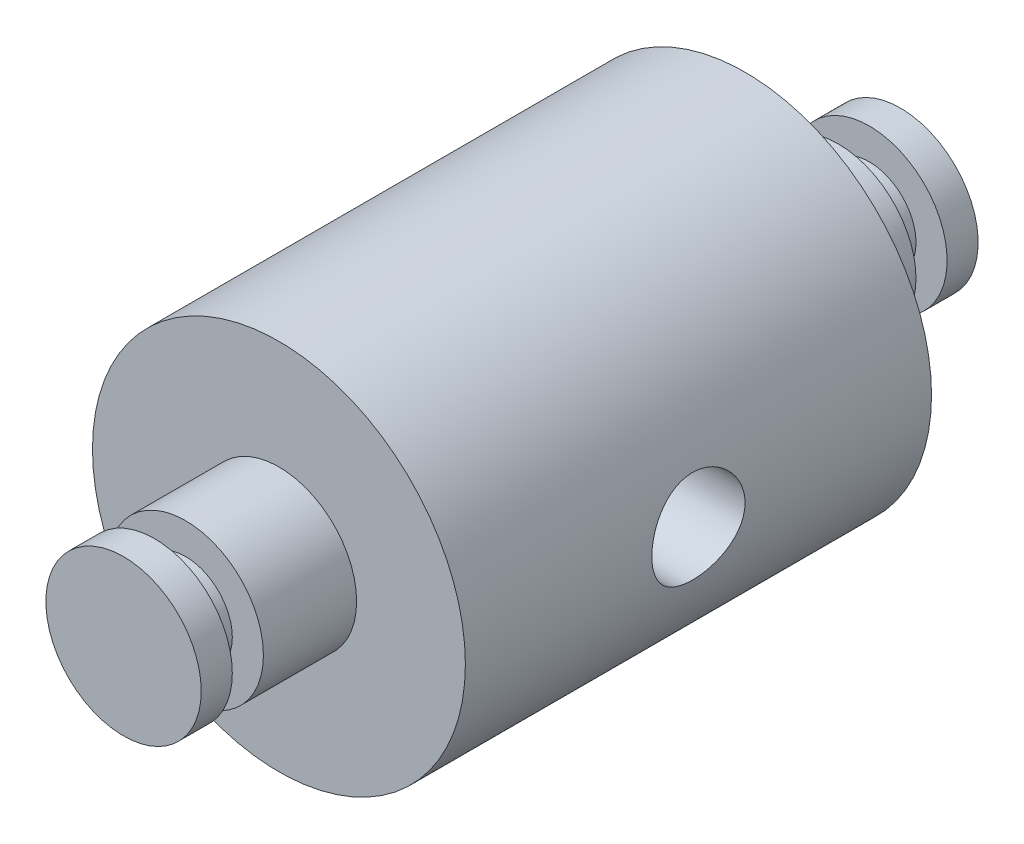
ISO-10303-21;
HEADER;
FILE_DESCRIPTION(('STEP AP214'),'2;1');
FILE_NAME('part.step','',(''),(''),'','','');
FILE_SCHEMA(('AUTOMOTIVE_DESIGN { 1 0 10303 214 1 1 1 1 }'));
ENDSEC;
DATA;
#1=APPLICATION_CONTEXT('core data for automotive mechanical design processes');
#2=APPLICATION_PROTOCOL_DEFINITION('international standard','automotive_design',2000,#1);
#3=PRODUCT_CONTEXT('',#1,'mechanical');
#4=PRODUCT('Part','Part','',(#3));
#5=PRODUCT_RELATED_PRODUCT_CATEGORY('part','',(#4));
#6=PRODUCT_DEFINITION_FORMATION('','',#4);
#7=PRODUCT_DEFINITION_CONTEXT('part definition',#1,'design');
#8=PRODUCT_DEFINITION('design','',#6,#7);
#9=PRODUCT_DEFINITION_SHAPE('','',#8);
#10=(LENGTH_UNIT() NAMED_UNIT(*) SI_UNIT(.MILLI.,.METRE.));
#11=(NAMED_UNIT(*) PLANE_ANGLE_UNIT() SI_UNIT($,.RADIAN.));
#12=(NAMED_UNIT(*) SI_UNIT($,.STERADIAN.) SOLID_ANGLE_UNIT());
#13=UNCERTAINTY_MEASURE_WITH_UNIT(LENGTH_MEASURE(1.E-05),#10,'distance_accuracy_value','');
#14=(GEOMETRIC_REPRESENTATION_CONTEXT(3) GLOBAL_UNCERTAINTY_ASSIGNED_CONTEXT((#13)) GLOBAL_UNIT_ASSIGNED_CONTEXT((#10,
#11,#12)) REPRESENTATION_CONTEXT('',''));
#15=CARTESIAN_POINT('',(0.,0.,0.));
#16=DIRECTION('',(0.,0.,1.));
#17=DIRECTION('',(1.,0.,0.));
#18=AXIS2_PLACEMENT_3D('',#15,#16,#17);
#19=CARTESIAN_POINT('',(0.,0.,-18.));
#20=DIRECTION('',(0.,0.,-1.));
#21=DIRECTION('',(-1.,0.,0.));
#22=AXIS2_PLACEMENT_3D('',#19,#20,#21);
#23=PLANE('',#22);
#24=CARTESIAN_POINT('',(0.,0.,-18.));
#25=DIRECTION('',(0.,0.,-1.));
#26=DIRECTION('',(-1.,0.,0.));
#27=AXIS2_PLACEMENT_3D('',#24,#25,#26);
#28=CIRCLE('',#27,2.5);
#29=CARTESIAN_POINT('',(-2.5,0.,-18.));
#30=VERTEX_POINT('',#29);
#31=EDGE_CURVE('E65',#30,#30,#28,.T.);
#32=ORIENTED_EDGE('',*,*,#31,.T.);
#33=EDGE_LOOP('',(#32));
#34=FACE_BOUND('',#33,.T.);
#35=CARTESIAN_POINT('',(0.,0.,-18.));
#36=DIRECTION('',(0.,0.,-1.));
#37=DIRECTION('',(-1.,0.,0.));
#38=AXIS2_PLACEMENT_3D('',#35,#36,#37);
#39=CIRCLE('',#38,1.5);
#40=CARTESIAN_POINT('',(-1.5,0.,-18.));
#41=VERTEX_POINT('',#40);
#42=EDGE_CURVE('E71',#41,#41,#39,.T.);
#43=ORIENTED_EDGE('',*,*,#42,.F.);
#44=EDGE_LOOP('',(#43));
#45=FACE_BOUND('',#44,.T.);
#46=ADVANCED_FACE('F26',(#34,#45),#23,.T.);
#47=CARTESIAN_POINT('',(0.,0.,-15.));
#48=DIRECTION('',(0.,0.,1.));
#49=DIRECTION('',(1.,0.,0.));
#50=AXIS2_PLACEMENT_3D('',#47,#48,#49);
#51=PLANE('',#50);
#52=CARTESIAN_POINT('',(0.,0.,-15.));
#53=DIRECTION('',(0.,0.,1.));
#54=DIRECTION('',(1.,0.,0.));
#55=AXIS2_PLACEMENT_3D('',#52,#53,#54);
#56=CIRCLE('',#55,6.);
#57=CARTESIAN_POINT('',(6.,0.,-15.));
#58=VERTEX_POINT('',#57);
#59=EDGE_CURVE('E38',#58,#58,#56,.T.);
#60=ORIENTED_EDGE('',*,*,#59,.F.);
#61=EDGE_LOOP('',(#60));
#62=FACE_BOUND('',#61,.T.);
#63=CARTESIAN_POINT('',(0.,0.,-15.));
#64=DIRECTION('',(0.,0.,1.));
#65=DIRECTION('',(1.,0.,0.));
#66=AXIS2_PLACEMENT_3D('',#63,#64,#65);
#67=CIRCLE('',#66,2.5);
#68=CARTESIAN_POINT('',(2.5,0.,-15.));
#69=VERTEX_POINT('',#68);
#70=EDGE_CURVE('E10',#69,#69,#67,.F.);
#71=ORIENTED_EDGE('',*,*,#70,.F.);
#72=EDGE_LOOP('',(#71));
#73=FACE_BOUND('',#72,.T.);
#74=ADVANCED_FACE('F122',(#62,#73),#51,.F.);
#75=CARTESIAN_POINT('',(0.,0.,3.));
#76=DIRECTION('',(0.,0.,1.));
#77=DIRECTION('',(1.,0.,0.));
#78=AXIS2_PLACEMENT_3D('',#75,#76,#77);
#79=PLANE('',#78);
#80=CARTESIAN_POINT('',(0.,0.,3.));
#81=DIRECTION('',(0.,0.,1.));
#82=DIRECTION('',(1.,0.,0.));
#83=AXIS2_PLACEMENT_3D('',#80,#81,#82);
#84=CIRCLE('',#83,2.5);
#85=CARTESIAN_POINT('',(2.5,0.,3.));
#86=VERTEX_POINT('',#85);
#87=EDGE_CURVE('E47',#86,#86,#84,.T.);
#88=ORIENTED_EDGE('',*,*,#87,.T.);
#89=EDGE_LOOP('',(#88));
#90=FACE_BOUND('',#89,.T.);
#91=CARTESIAN_POINT('',(0.,0.,3.));
#92=DIRECTION('',(0.,0.,1.));
#93=DIRECTION('',(1.,0.,0.));
#94=AXIS2_PLACEMENT_3D('',#91,#92,#93);
#95=CIRCLE('',#94,1.5);
#96=CARTESIAN_POINT('',(1.5,0.,3.));
#97=VERTEX_POINT('',#96);
#98=EDGE_CURVE('E56',#97,#97,#95,.T.);
#99=ORIENTED_EDGE('',*,*,#98,.F.);
#100=EDGE_LOOP('',(#99));
#101=FACE_BOUND('',#100,.T.);
#102=ADVANCED_FACE('F144',(#90,#101),#79,.T.);
#103=CARTESIAN_POINT('',(0.,0.,0.));
#104=DIRECTION('',(0.,0.,1.));
#105=DIRECTION('',(1.,0.,0.));
#106=AXIS2_PLACEMENT_3D('',#103,#104,#105);
#107=PLANE('',#106);
#108=CARTESIAN_POINT('',(0.,0.,0.));
#109=DIRECTION('',(0.,0.,1.));
#110=DIRECTION('',(1.,0.,0.));
#111=AXIS2_PLACEMENT_3D('',#108,#109,#110);
#112=CIRCLE('',#111,6.);
#113=CARTESIAN_POINT('',(6.,0.,0.));
#114=VERTEX_POINT('',#113);
#115=EDGE_CURVE('E42',#114,#114,#112,.T.);
#116=ORIENTED_EDGE('',*,*,#115,.T.);
#117=EDGE_LOOP('',(#116));
#118=FACE_BOUND('',#117,.T.);
#119=CARTESIAN_POINT('',(0.,0.,0.));
#120=DIRECTION('',(0.,0.,1.));
#121=DIRECTION('',(1.,0.,0.));
#122=AXIS2_PLACEMENT_3D('',#119,#120,#121);
#123=CIRCLE('',#122,2.5);
#124=CARTESIAN_POINT('',(2.5,0.,0.));
#125=VERTEX_POINT('',#124);
#126=EDGE_CURVE('E50',#125,#125,#123,.T.);
#127=ORIENTED_EDGE('',*,*,#126,.F.);
#128=EDGE_LOOP('',(#127));
#129=FACE_BOUND('',#128,.T.);
#130=ADVANCED_FACE('F147',(#118,#129),#107,.T.);
#131=CARTESIAN_POINT('',(0.,0.,-15.));
#132=DIRECTION('',(0.,0.,1.));
#133=DIRECTION('',(1.,0.,0.));
#134=AXIS2_PLACEMENT_3D('',#131,#132,#133);
#135=CYLINDRICAL_SURFACE('',#134,6.);
#136=CARTESIAN_POINT('',(6.,0.,-9.));
#137=CARTESIAN_POINT('',(5.99999859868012,0.0828760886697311,-8.99999767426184));
#138=CARTESIAN_POINT('',(5.99826578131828,0.165778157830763,-8.99310844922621));
#139=CARTESIAN_POINT('',(5.99152113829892,0.329206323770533,-8.96577484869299));
#140=CARTESIAN_POINT('',(5.98650745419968,0.409731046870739,-8.94532279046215));
#141=CARTESIAN_POINT('',(5.9737562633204,0.566020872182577,-8.89156074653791));
#142=CARTESIAN_POINT('',(5.96602202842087,0.641791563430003,-8.85826620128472));
#143=CARTESIAN_POINT('',(5.94865343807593,0.786672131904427,-8.77981860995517));
#144=CARTESIAN_POINT('',(5.9390190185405,0.85578178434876,-8.73466516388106));
#145=CARTESIAN_POINT('',(5.91867413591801,0.98680192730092,-8.63279921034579));
#146=CARTESIAN_POINT('',(5.90794707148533,1.04855569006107,-8.57588842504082));
#147=CARTESIAN_POINT('',(5.88673620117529,1.16174892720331,-8.45254779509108));
#148=CARTESIAN_POINT('',(5.87625242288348,1.21318723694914,-8.3861168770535));
#149=CARTESIAN_POINT('',(5.8565477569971,1.30502654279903,-8.24440477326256));
#150=CARTESIAN_POINT('',(5.84734794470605,1.34525221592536,-8.1690067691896));
#151=CARTESIAN_POINT('',(5.83149494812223,1.41239690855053,-8.01225158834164));
#152=CARTESIAN_POINT('',(5.82484135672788,1.43931805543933,-7.93089536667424));
#153=CARTESIAN_POINT('',(5.8150047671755,1.47855483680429,-7.76625650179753));
#154=CARTESIAN_POINT('',(5.81175491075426,1.49115226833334,-7.6830451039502));
#155=CARTESIAN_POINT('',(5.80889362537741,1.50226177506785,-7.51563143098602));
#156=CARTESIAN_POINT('',(5.80928160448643,1.50077614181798,-7.43142931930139));
#157=CARTESIAN_POINT('',(5.81359205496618,1.48398652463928,-7.26658419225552));
#158=CARTESIAN_POINT('',(5.81742863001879,1.46901834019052,-7.1859043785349));
#159=CARTESIAN_POINT('',(5.82806709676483,1.42622418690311,-7.02823894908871));
#160=CARTESIAN_POINT('',(5.83486919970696,1.39839730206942,-6.95125359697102));
#161=CARTESIAN_POINT('',(5.85075113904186,1.33038947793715,-6.80226198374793));
#162=CARTESIAN_POINT('',(5.85985327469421,1.29008666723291,-6.73031382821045));
#163=CARTESIAN_POINT('',(5.87929710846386,1.19835627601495,-6.59408129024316));
#164=CARTESIAN_POINT('',(5.88963902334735,1.14692674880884,-6.52979825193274));
#165=CARTESIAN_POINT('',(5.91075880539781,1.03266342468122,-6.4087963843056));
#166=CARTESIAN_POINT('',(5.92154069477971,0.969546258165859,-6.35234550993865));
#167=CARTESIAN_POINT('',(5.94205965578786,0.8346119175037,-6.25077875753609));
#168=CARTESIAN_POINT('',(5.95179669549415,0.762794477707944,-6.20566322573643));
#169=CARTESIAN_POINT('',(5.96917732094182,0.612115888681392,-6.12794941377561));
#170=CARTESIAN_POINT('',(5.97681360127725,0.533231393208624,-6.09539465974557));
#171=CARTESIAN_POINT('',(5.98907916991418,0.370876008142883,-6.04408269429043));
#172=CARTESIAN_POINT('',(5.99370903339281,0.287405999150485,-6.02532284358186));
#173=CARTESIAN_POINT('',(5.99935499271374,0.120539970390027,-6.00254243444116));
#174=CARTESIAN_POINT('',(6.00046053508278,0.0371967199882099,-5.9981569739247));
#175=CARTESIAN_POINT('',(5.99918804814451,-0.129032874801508,-6.00324900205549));
#176=CARTESIAN_POINT('',(5.99681033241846,-0.211919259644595,-6.01272524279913));
#177=CARTESIAN_POINT('',(5.98889581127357,-0.373614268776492,-6.04497090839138));
#178=CARTESIAN_POINT('',(5.98340634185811,-0.452465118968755,-6.06754126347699));
#179=CARTESIAN_POINT('',(5.96988706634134,-0.605257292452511,-6.12510708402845));
#180=CARTESIAN_POINT('',(5.96185700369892,-0.679198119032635,-6.16010380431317));
#181=CARTESIAN_POINT('',(5.9439330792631,-0.821523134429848,-6.24223612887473));
#182=CARTESIAN_POINT('',(5.93400867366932,-0.889785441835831,-6.28957611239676));
#183=CARTESIAN_POINT('',(5.91344509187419,-1.01752661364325,-6.39478990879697));
#184=CARTESIAN_POINT('',(5.90280579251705,-1.07700395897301,-6.45266553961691));
#185=CARTESIAN_POINT('',(5.88168956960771,-1.18699056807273,-6.57900196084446));
#186=CARTESIAN_POINT('',(5.87122304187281,-1.23724386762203,-6.64768770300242));
#187=CARTESIAN_POINT('',(5.85192878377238,-1.3255107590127,-6.79273263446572));
#188=CARTESIAN_POINT('',(5.84310098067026,-1.36352489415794,-6.86909148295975));
#189=CARTESIAN_POINT('',(5.82818094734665,-1.42595142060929,-7.02690572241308));
#190=CARTESIAN_POINT('',(5.82207255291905,-1.45044439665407,-7.10832762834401));
#191=CARTESIAN_POINT('',(5.81326744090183,-1.48534565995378,-7.27430963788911));
#192=CARTESIAN_POINT('',(5.81056997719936,-1.49575702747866,-7.35886905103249));
#193=CARTESIAN_POINT('',(5.80894901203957,-1.502038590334,-7.5261210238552));
#194=CARTESIAN_POINT('',(5.80991932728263,-1.49831789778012,-7.60879743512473));
#195=CARTESIAN_POINT('',(5.81527909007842,-1.47737727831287,-7.77230388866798));
#196=CARTESIAN_POINT('',(5.81966846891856,-1.46015762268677,-7.85313396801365));
#197=CARTESIAN_POINT('',(5.83131260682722,-1.41293131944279,-8.01020845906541));
#198=CARTESIAN_POINT('',(5.83855015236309,-1.38300140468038,-8.08647730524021));
#199=CARTESIAN_POINT('',(5.85507755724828,-1.31126491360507,-8.23296538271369));
#200=CARTESIAN_POINT('',(5.86436770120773,-1.26945669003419,-8.30318377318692));
#201=CARTESIAN_POINT('',(5.88425634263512,-1.17386774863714,-8.43755462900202));
#202=CARTESIAN_POINT('',(5.89488264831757,-1.11980316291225,-8.50150107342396));
#203=CARTESIAN_POINT('',(5.91608027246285,-1.00178937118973,-8.61954704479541));
#204=CARTESIAN_POINT('',(5.92665157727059,-0.937837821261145,-8.67364423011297));
#205=CARTESIAN_POINT('',(5.94677655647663,-0.80046758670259,-8.77141130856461));
#206=CARTESIAN_POINT('',(5.95630833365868,-0.726898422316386,-8.81487461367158));
#207=CARTESIAN_POINT('',(5.97304924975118,-0.573266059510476,-8.88874746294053));
#208=CARTESIAN_POINT('',(5.98026005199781,-0.493207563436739,-8.91916636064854));
#209=CARTESIAN_POINT('',(5.99048059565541,-0.344410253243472,-8.96157183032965));
#210=CARTESIAN_POINT('',(5.9940258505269,-0.276380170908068,-8.97595124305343));
#211=CARTESIAN_POINT('',(5.99878605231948,-0.138906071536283,-8.99516594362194));
#212=CARTESIAN_POINT('',(6.00000117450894,-0.0694621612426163,-9.0000019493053));
#213=CARTESIAN_POINT('',(6.,0.,-9.));
#214=B_SPLINE_CURVE_WITH_KNOTS('',3,(#136,#137,#138,#139,#140,#141,#142,#143,#144,#145,#146,
#147,#148,#149,#150,#151,#152,#153,#154,#155,#156,#157,#158,#159,#160,#161,#162,#163,#164,#165,
#166,#167,#168,#169,#170,#171,#172,#173,#174,#175,#176,#177,#178,#179,#180,#181,#182,#183,#184,
#185,#186,#187,#188,#189,#190,#191,#192,#193,#194,#195,#196,#197,#198,#199,#200,#201,#202,#203,
#204,#205,#206,#207,#208,#209,#210,#211,#212,#213),.UNSPECIFIED.,.T.,.F.,(4,2,2,2,2,2,2,2,2,2,2,
2,2,2,2,2,2,2,2,2,2,2,2,2,2,2,2,2,2,2,2,2,2,2,2,2,2,2,4),(0.,0.24837371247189,0.4968882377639,
0.745104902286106,0.993329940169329,1.24614435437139,1.49898729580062,1.75558647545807,
2.01214461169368,2.2635629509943,2.51494038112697,2.76022497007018,3.00552703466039,
3.25330527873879,3.50112690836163,3.75601500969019,4.01091089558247,4.26668229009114,
4.52240473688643,4.77158308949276,5.02073901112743,5.26620274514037,5.51169127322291,
5.76153587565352,6.01142363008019,6.26744509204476,6.52345518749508,6.77792254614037,
7.03233423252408,7.27943780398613,7.52653640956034,7.77216400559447,8.01782568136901,
8.2698957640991,8.52202569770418,8.77872185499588,9.0352336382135,9.24342242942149,
9.4515955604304),.UNSPECIFIED.);
#215=CARTESIAN_POINT('',(6.,0.,-9.));
#216=VERTEX_POINT('',#215);
#217=EDGE_CURVE('E83',#216,#216,#214,.T.);
#218=ORIENTED_EDGE('',*,*,#217,.F.);
#219=EDGE_LOOP('',(#218));
#220=FACE_BOUND('',#219,.T.);
#221=CARTESIAN_POINT('',(-6.,0.,-11.5));
#222=CARTESIAN_POINT('',(-5.9999978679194,-0.200961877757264,-11.499997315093));
#223=CARTESIAN_POINT('',(-5.9898153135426,-0.401936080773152,-11.4847711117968));
#224=CARTESIAN_POINT('',(-5.95009379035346,-0.79746821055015,-11.4248072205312));
#225=CARTESIAN_POINT('',(-5.92054563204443,-0.992023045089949,-11.3800555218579));
#226=CARTESIAN_POINT('',(-5.84500964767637,-1.36842380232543,-11.2637845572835));
#227=CARTESIAN_POINT('',(-5.79909884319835,-1.55032457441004,-11.1923906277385));
#228=CARTESIAN_POINT('',(-5.69452202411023,-1.89883175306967,-11.0258723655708));
#229=CARTESIAN_POINT('',(-5.63585415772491,-2.06543593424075,-10.930744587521));
#230=CARTESIAN_POINT('',(-5.50454977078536,-2.3945652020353,-10.7106900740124));
#231=CARTESIAN_POINT('',(-5.43115036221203,-2.55554447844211,-10.5839196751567));
#232=CARTESIAN_POINT('',(-5.27963383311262,-2.85547224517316,-10.3085244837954));
#233=CARTESIAN_POINT('',(-5.20151004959,-2.994388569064,-10.1598683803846));
#234=CARTESIAN_POINT('',(-5.07935723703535,-3.19492879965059,-9.90961614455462));
#235=CARTESIAN_POINT('',(-5.03481061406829,-3.26448421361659,-9.81452998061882));
#236=CARTESIAN_POINT('',(-4.94754748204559,-3.39528506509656,-9.6180170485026));
#237=CARTESIAN_POINT('',(-4.90483139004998,-3.45652861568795,-9.51658884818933));
#238=CARTESIAN_POINT('',(-4.78172496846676,-3.62693348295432,-9.20342381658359));
#239=CARTESIAN_POINT('',(-4.70611539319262,-3.72317686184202,-8.98230114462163));
#240=CARTESIAN_POINT('',(-4.59951859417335,-3.85349251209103,-8.5865532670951));
#241=CARTESIAN_POINT('',(-4.56195075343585,-3.89749210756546,-8.41693662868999));
#242=CARTESIAN_POINT('',(-4.5051611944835,-3.96300919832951,-8.07051744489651));
#243=CARTESIAN_POINT('',(-4.48590785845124,-3.98456544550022,-7.89372783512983));
#244=CARTESIAN_POINT('',(-4.46873162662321,-4.0038281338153,-7.53704870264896));
#245=CARTESIAN_POINT('',(-4.47089592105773,-4.00143708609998,-7.35714948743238));
#246=CARTESIAN_POINT('',(-4.49639563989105,-3.97275139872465,-7.00073051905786));
#247=CARTESIAN_POINT('',(-4.51974900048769,-3.94643650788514,-6.82421375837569));
#248=CARTESIAN_POINT('',(-4.58254368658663,-3.8732999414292,-6.48706578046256));
#249=CARTESIAN_POINT('',(-4.62122975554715,-3.82743424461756,-6.32607729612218));
#250=CARTESIAN_POINT('',(-4.71019246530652,-3.71740235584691,-6.01395264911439));
#251=CARTESIAN_POINT('',(-4.7604729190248,-3.65323014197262,-5.86281974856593));
#252=CARTESIAN_POINT('',(-4.87928392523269,-3.49347638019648,-5.54194919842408));
#253=CARTESIAN_POINT('',(-4.94944635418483,-3.3941610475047,-5.37468019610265));
#254=CARTESIAN_POINT('',(-5.09383075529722,-3.17337920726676,-5.0572332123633));
#255=CARTESIAN_POINT('',(-5.16805765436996,-3.05188537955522,-4.90707668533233));
#256=CARTESIAN_POINT('',(-5.33086687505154,-2.75962330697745,-4.59491490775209));
#257=CARTESIAN_POINT('',(-5.41909489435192,-2.58387876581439,-4.43733190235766));
#258=CARTESIAN_POINT('',(-5.58436201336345,-2.20401599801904,-4.15360701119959));
#259=CARTESIAN_POINT('',(-5.66141155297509,-1.99992459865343,-4.02743570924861));
#260=CARTESIAN_POINT('',(-5.78290808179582,-1.60971565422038,-3.83304456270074));
#261=CARTESIAN_POINT('',(-5.83078522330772,-1.42791528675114,-3.75831327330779));
#262=CARTESIAN_POINT('',(-5.91015438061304,-1.05207208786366,-3.63579014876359));
#263=CARTESIAN_POINT('',(-5.94166024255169,-0.858039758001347,-3.58797554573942));
#264=CARTESIAN_POINT('',(-5.98551764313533,-0.461970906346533,-3.52167766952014));
#265=CARTESIAN_POINT('',(-5.9977864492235,-0.259903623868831,-3.50332107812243));
#266=CARTESIAN_POINT('',(-6.00166229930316,0.144883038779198,-3.49750582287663));
#267=CARTESIAN_POINT('',(-5.99327078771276,0.347602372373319,-3.51004499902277));
#268=CARTESIAN_POINT('',(-5.95799178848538,0.732911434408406,-3.56324811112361));
#269=CARTESIAN_POINT('',(-5.93244492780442,0.915914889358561,-3.60187459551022));
#270=CARTESIAN_POINT('',(-5.86636898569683,1.27223278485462,-3.70319137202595));
#271=CARTESIAN_POINT('',(-5.82583751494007,1.44554567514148,-3.76588550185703));
#272=CARTESIAN_POINT('',(-5.72992705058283,1.78932950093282,-3.91730459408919));
#273=CARTESIAN_POINT('',(-5.6737974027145,1.95899236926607,-4.00737630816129));
#274=CARTESIAN_POINT('',(-5.55203711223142,2.28136604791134,-4.20886657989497));
#275=CARTESIAN_POINT('',(-5.48640060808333,2.4340662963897,-4.32029832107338));
#276=CARTESIAN_POINT('',(-5.33909093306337,2.7437089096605,-4.58121573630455));
#277=CARTESIAN_POINT('',(-5.25652313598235,2.89750375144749,-4.73393252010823));
#278=CARTESIAN_POINT('',(-5.09142346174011,3.17867936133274,-5.0622228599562));
#279=CARTESIAN_POINT('',(-5.00889164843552,3.30604187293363,-5.23781207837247));
#280=CARTESIAN_POINT('',(-4.85879357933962,3.52249553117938,-5.59428482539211));
#281=CARTESIAN_POINT('',(-4.79055194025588,3.61391272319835,-5.77346406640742));
#282=CARTESIAN_POINT('',(-4.66877948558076,3.76992427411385,-6.14774530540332));
#283=CARTESIAN_POINT('',(-4.61522225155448,3.83456691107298,-6.342817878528));
#284=CARTESIAN_POINT('',(-4.53866416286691,3.9247168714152,-6.70912897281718));
#285=CARTESIAN_POINT('',(-4.51189995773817,3.95517195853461,-6.87834361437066));
#286=CARTESIAN_POINT('',(-4.477589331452,3.99398411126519,-7.22114656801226));
#287=CARTESIAN_POINT('',(-4.47002203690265,4.00236517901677,-7.39472992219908));
#288=CARTESIAN_POINT('',(-4.47528401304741,3.99647846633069,-7.74128609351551));
#289=CARTESIAN_POINT('',(-4.48812536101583,3.98219727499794,-7.91425848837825));
#290=CARTESIAN_POINT('',(-4.53220908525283,3.93193984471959,-8.25468713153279));
#291=CARTESIAN_POINT('',(-4.56347600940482,3.89593466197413,-8.42213570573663));
#292=CARTESIAN_POINT('',(-4.65053670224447,3.7918611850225,-8.79142202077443));
#293=CARTESIAN_POINT('',(-4.71064593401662,3.71780572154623,-8.99053394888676));
#294=CARTESIAN_POINT('',(-4.8444439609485,3.5416885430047,-9.37097514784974));
#295=CARTESIAN_POINT('',(-4.91815177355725,3.43958750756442,-9.55227896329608));
#296=CARTESIAN_POINT('',(-5.07234090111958,3.20797320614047,-9.89855810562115));
#297=CARTESIAN_POINT('',(-5.1529210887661,3.07799480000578,-10.0631761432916));
#298=CARTESIAN_POINT('',(-5.31257669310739,2.79340674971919,-10.3706663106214));
#299=CARTESIAN_POINT('',(-5.39165164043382,2.63878955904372,-10.5135317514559));
#300=CARTESIAN_POINT('',(-5.50971336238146,2.37780795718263,-10.7187950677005));
#301=CARTESIAN_POINT('',(-5.55138661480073,2.27907205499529,-10.7894836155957));
#302=CARTESIAN_POINT('',(-5.63101613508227,2.07453205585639,-10.9221578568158));
#303=CARTESIAN_POINT('',(-5.66897410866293,1.96873124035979,-10.9841475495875));
#304=CARTESIAN_POINT('',(-5.74005451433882,1.75068617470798,-11.0986438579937));
#305=CARTESIAN_POINT('',(-5.77318143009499,1.63844803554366,-11.1511592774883));
#306=CARTESIAN_POINT('',(-5.83360071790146,1.4082892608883,-11.245961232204));
#307=CARTESIAN_POINT('',(-5.86089513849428,1.29037063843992,-11.2882513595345));
#308=CARTESIAN_POINT('',(-5.92199193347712,0.982973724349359,-11.3822568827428));
#309=CARTESIAN_POINT('',(-5.95101863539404,0.790052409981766,-11.4262080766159));
#310=CARTESIAN_POINT('',(-5.99001656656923,0.398088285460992,-11.4850700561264));
#311=CARTESIAN_POINT('',(-6.00000211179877,0.199050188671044,-11.5000026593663));
#312=CARTESIAN_POINT('',(-6.,0.,-11.5));
#313=B_SPLINE_CURVE_WITH_KNOTS('',3,(#221,#222,#223,#224,#225,#226,#227,#228,#229,#230,#231,
#232,#233,#234,#235,#236,#237,#238,#239,#240,#241,#242,#243,#244,#245,#246,#247,#248,#249,#250,
#251,#252,#253,#254,#255,#256,#257,#258,#259,#260,#261,#262,#263,#264,#265,#266,#267,#268,#269,
#270,#271,#272,#273,#274,#275,#276,#277,#278,#279,#280,#281,#282,#283,#284,#285,#286,#287,#288,
#289,#290,#291,#292,#293,#294,#295,#296,#297,#298,#299,#300,#301,#302,#303,#304,#305,#306,#307,
#308,#309,#310,#311,#312),.UNSPECIFIED.,.T.,.F.,(4,2,2,2,2,2,2,2,2,2,2,2,2,2,2,2,2,2,2,2,2,2,2,
2,2,2,2,2,2,2,2,2,2,2,2,2,2,2,2,2,2,2,2,2,2,4),(0.,0.602106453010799,1.20449882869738,
1.80409230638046,2.40377287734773,3.05434058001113,3.70584823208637,4.08328599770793,
4.46080930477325,5.21378174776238,5.74934951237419,6.28399099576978,6.82080987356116,
7.35808358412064,7.87165288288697,8.38539131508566,9.00362713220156,9.62262971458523,
10.3750547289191,11.1267724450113,11.7311573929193,12.3350303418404,12.9414933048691,
13.5479138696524,14.1117373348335,14.6756507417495,15.2737225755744,15.8721647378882,
16.5652391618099,17.2587907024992,17.8936743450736,18.5274081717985,19.0471565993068,
19.5663396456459,20.085830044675,20.6060141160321,21.2648078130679,21.9245299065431,
22.5962605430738,23.2681973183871,23.6528866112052,24.0373984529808,24.4215511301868,
24.8055686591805,25.4023963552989,25.9987751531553),.UNSPECIFIED.);
#314=CARTESIAN_POINT('',(-6.,0.,-11.5));
#315=VERTEX_POINT('',#314);
#316=EDGE_CURVE('E31',#315,#315,#313,.T.);
#317=ORIENTED_EDGE('',*,*,#316,.F.);
#318=EDGE_LOOP('',(#317));
#319=FACE_BOUND('',#318,.T.);
#320=ORIENTED_EDGE('',*,*,#59,.T.);
#321=EDGE_LOOP('',(#320));
#322=FACE_BOUND('',#321,.T.);
#323=ORIENTED_EDGE('',*,*,#115,.F.);
#324=EDGE_LOOP('',(#323));
#325=FACE_BOUND('',#324,.T.);
#326=ADVANCED_FACE('F28',(#220,#319,#322,#325),#135,.T.);
#327=CARTESIAN_POINT('',(0.,0.,3.));
#328=DIRECTION('',(0.,0.,-1.));
#329=DIRECTION('',(-1.,0.,0.));
#330=AXIS2_PLACEMENT_3D('',#327,#328,#329);
#331=CYLINDRICAL_SURFACE('',#330,2.5);
#332=ORIENTED_EDGE('',*,*,#87,.F.);
#333=EDGE_LOOP('',(#332));
#334=FACE_BOUND('',#333,.T.);
#335=ORIENTED_EDGE('',*,*,#126,.T.);
#336=EDGE_LOOP('',(#335));
#337=FACE_BOUND('',#336,.T.);
#338=ADVANCED_FACE('F142',(#334,#337),#331,.T.);
#339=CARTESIAN_POINT('',(0.,0.,4.));
#340=DIRECTION('',(0.,0.,-1.));
#341=DIRECTION('',(-1.,0.,0.));
#342=AXIS2_PLACEMENT_3D('',#339,#340,#341);
#343=CYLINDRICAL_SURFACE('',#342,1.5);
#344=CARTESIAN_POINT('',(0.,0.,4.));
#345=DIRECTION('',(0.,0.,1.));
#346=DIRECTION('',(1.,0.,0.));
#347=AXIS2_PLACEMENT_3D('',#344,#345,#346);
#348=CIRCLE('',#347,1.5);
#349=CARTESIAN_POINT('',(1.5,0.,4.));
#350=VERTEX_POINT('',#349);
#351=EDGE_CURVE('E53',#350,#350,#348,.T.);
#352=ORIENTED_EDGE('',*,*,#351,.F.);
#353=EDGE_LOOP('',(#352));
#354=FACE_BOUND('',#353,.T.);
#355=ORIENTED_EDGE('',*,*,#98,.T.);
#356=EDGE_LOOP('',(#355));
#357=FACE_BOUND('',#356,.T.);
#358=ADVANCED_FACE('F132',(#354,#357),#343,.T.);
#359=CARTESIAN_POINT('',(0.,0.,4.));
#360=DIRECTION('',(0.,0.,1.));
#361=DIRECTION('',(1.,0.,0.));
#362=AXIS2_PLACEMENT_3D('',#359,#360,#361);
#363=PLANE('',#362);
#364=CARTESIAN_POINT('',(0.,0.,4.));
#365=DIRECTION('',(0.,0.,1.));
#366=DIRECTION('',(1.,0.,0.));
#367=AXIS2_PLACEMENT_3D('',#364,#365,#366);
#368=CIRCLE('',#367,2.5);
#369=CARTESIAN_POINT('',(2.5,0.,4.));
#370=VERTEX_POINT('',#369);
#371=EDGE_CURVE('E62',#370,#370,#368,.T.);
#372=ORIENTED_EDGE('',*,*,#371,.F.);
#373=EDGE_LOOP('',(#372));
#374=FACE_BOUND('',#373,.T.);
#375=ORIENTED_EDGE('',*,*,#351,.T.);
#376=EDGE_LOOP('',(#375));
#377=FACE_BOUND('',#376,.T.);
#378=ADVANCED_FACE('F128',(#374,#377),#363,.F.);
#379=CARTESIAN_POINT('',(0.,0.,5.));
#380=DIRECTION('',(0.,0.,-1.));
#381=DIRECTION('',(-1.,0.,0.));
#382=AXIS2_PLACEMENT_3D('',#379,#380,#381);
#383=CYLINDRICAL_SURFACE('',#382,2.5);
#384=CARTESIAN_POINT('',(0.,0.,5.));
#385=DIRECTION('',(0.,0.,1.));
#386=DIRECTION('',(1.,0.,0.));
#387=AXIS2_PLACEMENT_3D('',#384,#385,#386);
#388=CIRCLE('',#387,2.5);
#389=CARTESIAN_POINT('',(2.5,0.,5.));
#390=VERTEX_POINT('',#389);
#391=EDGE_CURVE('E59',#390,#390,#388,.T.);
#392=ORIENTED_EDGE('',*,*,#391,.F.);
#393=EDGE_LOOP('',(#392));
#394=FACE_BOUND('',#393,.T.);
#395=ORIENTED_EDGE('',*,*,#371,.T.);
#396=EDGE_LOOP('',(#395));
#397=FACE_BOUND('',#396,.T.);
#398=ADVANCED_FACE('F131',(#394,#397),#383,.T.);
#399=CARTESIAN_POINT('',(0.,0.,5.));
#400=DIRECTION('',(0.,0.,1.));
#401=DIRECTION('',(1.,0.,0.));
#402=AXIS2_PLACEMENT_3D('',#399,#400,#401);
#403=PLANE('',#402);
#404=ORIENTED_EDGE('',*,*,#391,.T.);
#405=EDGE_LOOP('',(#404));
#406=FACE_BOUND('',#405,.T.);
#407=ADVANCED_FACE('F126',(#406),#403,.T.);
#408=CARTESIAN_POINT('',(0.,0.,-18.));
#409=DIRECTION('',(0.,0.,1.));
#410=DIRECTION('',(1.,0.,0.));
#411=AXIS2_PLACEMENT_3D('',#408,#409,#410);
#412=CYLINDRICAL_SURFACE('',#411,2.5);
#413=ORIENTED_EDGE('',*,*,#31,.F.);
#414=EDGE_LOOP('',(#413));
#415=FACE_BOUND('',#414,.T.);
#416=ORIENTED_EDGE('',*,*,#70,.T.);
#417=EDGE_LOOP('',(#416));
#418=FACE_BOUND('',#417,.T.);
#419=ADVANCED_FACE('F118',(#415,#418),#412,.T.);
#420=CARTESIAN_POINT('',(0.,0.,-19.));
#421=DIRECTION('',(0.,0.,1.));
#422=DIRECTION('',(1.,0.,0.));
#423=AXIS2_PLACEMENT_3D('',#420,#421,#422);
#424=CYLINDRICAL_SURFACE('',#423,1.5);
#425=CARTESIAN_POINT('',(0.,0.,-19.));
#426=DIRECTION('',(0.,0.,-1.));
#427=DIRECTION('',(-1.,0.,0.));
#428=AXIS2_PLACEMENT_3D('',#425,#426,#427);
#429=CIRCLE('',#428,1.5);
#430=CARTESIAN_POINT('',(-1.5,0.,-19.));
#431=VERTEX_POINT('',#430);
#432=EDGE_CURVE('E68',#431,#431,#429,.T.);
#433=ORIENTED_EDGE('',*,*,#432,.F.);
#434=EDGE_LOOP('',(#433));
#435=FACE_BOUND('',#434,.T.);
#436=ORIENTED_EDGE('',*,*,#42,.T.);
#437=EDGE_LOOP('',(#436));
#438=FACE_BOUND('',#437,.T.);
#439=ADVANCED_FACE('F108',(#435,#438),#424,.T.);
#440=CARTESIAN_POINT('',(0.,0.,-19.));
#441=DIRECTION('',(0.,0.,-1.));
#442=DIRECTION('',(-1.,0.,0.));
#443=AXIS2_PLACEMENT_3D('',#440,#441,#442);
#444=PLANE('',#443);
#445=CARTESIAN_POINT('',(0.,0.,-19.));
#446=DIRECTION('',(0.,0.,-1.));
#447=DIRECTION('',(-1.,0.,0.));
#448=AXIS2_PLACEMENT_3D('',#445,#446,#447);
#449=CIRCLE('',#448,2.5);
#450=CARTESIAN_POINT('',(-2.5,0.,-19.));
#451=VERTEX_POINT('',#450);
#452=EDGE_CURVE('E77',#451,#451,#449,.T.);
#453=ORIENTED_EDGE('',*,*,#452,.F.);
#454=EDGE_LOOP('',(#453));
#455=FACE_BOUND('',#454,.T.);
#456=ORIENTED_EDGE('',*,*,#432,.T.);
#457=EDGE_LOOP('',(#456));
#458=FACE_BOUND('',#457,.T.);
#459=ADVANCED_FACE('F104',(#455,#458),#444,.F.);
#460=CARTESIAN_POINT('',(0.,0.,-20.));
#461=DIRECTION('',(0.,0.,1.));
#462=DIRECTION('',(1.,0.,0.));
#463=AXIS2_PLACEMENT_3D('',#460,#461,#462);
#464=CYLINDRICAL_SURFACE('',#463,2.5);
#465=CARTESIAN_POINT('',(0.,0.,-20.));
#466=DIRECTION('',(0.,0.,-1.));
#467=DIRECTION('',(-1.,0.,0.));
#468=AXIS2_PLACEMENT_3D('',#465,#466,#467);
#469=CIRCLE('',#468,2.5);
#470=CARTESIAN_POINT('',(-2.5,0.,-20.));
#471=VERTEX_POINT('',#470);
#472=EDGE_CURVE('E74',#471,#471,#469,.T.);
#473=ORIENTED_EDGE('',*,*,#472,.F.);
#474=EDGE_LOOP('',(#473));
#475=FACE_BOUND('',#474,.T.);
#476=ORIENTED_EDGE('',*,*,#452,.T.);
#477=EDGE_LOOP('',(#476));
#478=FACE_BOUND('',#477,.T.);
#479=ADVANCED_FACE('F107',(#475,#478),#464,.T.);
#480=CARTESIAN_POINT('',(0.,0.,-20.));
#481=DIRECTION('',(0.,0.,-1.));
#482=DIRECTION('',(-1.,0.,0.));
#483=AXIS2_PLACEMENT_3D('',#480,#481,#482);
#484=PLANE('',#483);
#485=ORIENTED_EDGE('',*,*,#472,.T.);
#486=EDGE_LOOP('',(#485));
#487=FACE_BOUND('',#486,.T.);
#488=ADVANCED_FACE('F102',(#487),#484,.T.);
#489=CARTESIAN_POINT('',(-13.,0.,-7.5));
#490=DIRECTION('',(1.,0.,0.));
#491=DIRECTION('',(0.,0.,-1.));
#492=AXIS2_PLACEMENT_3D('',#489,#490,#491);
#493=CYLINDRICAL_SURFACE('',#492,4.);
#494=ORIENTED_EDGE('',*,*,#316,.T.);
#495=EDGE_LOOP('',(#494));
#496=FACE_BOUND('',#495,.T.);
#497=CARTESIAN_POINT('',(0.,0.,-7.5));
#498=DIRECTION('',(1.,0.,0.));
#499=DIRECTION('',(0.,0.,-1.));
#500=AXIS2_PLACEMENT_3D('',#497,#498,#499);
#501=CIRCLE('',#500,4.);
#502=CARTESIAN_POINT('',(0.,0.,-11.5));
#503=VERTEX_POINT('',#502);
#504=EDGE_CURVE('E80',#503,#503,#501,.T.);
#505=ORIENTED_EDGE('',*,*,#504,.T.);
#506=EDGE_LOOP('',(#505));
#507=FACE_BOUND('',#506,.T.);
#508=ADVANCED_FACE('F97',(#496,#507),#493,.F.);
#509=CARTESIAN_POINT('',(0.,0.,-7.5));
#510=DIRECTION('',(1.,0.,0.));
#511=DIRECTION('',(0.,0.,-1.));
#512=AXIS2_PLACEMENT_3D('',#509,#510,#511);
#513=PLANE('',#512);
#514=CARTESIAN_POINT('',(0.,0.,-7.5));
#515=DIRECTION('',(-1.,0.,0.));
#516=DIRECTION('',(0.,0.,1.));
#517=AXIS2_PLACEMENT_3D('',#514,#515,#516);
#518=CIRCLE('',#517,1.5);
#519=CARTESIAN_POINT('',(0.,0.,-6.));
#520=VERTEX_POINT('',#519);
#521=EDGE_CURVE('E89',#520,#520,#518,.T.);
#522=ORIENTED_EDGE('',*,*,#521,.F.);
#523=EDGE_LOOP('',(#522));
#524=FACE_BOUND('',#523,.T.);
#525=ORIENTED_EDGE('',*,*,#504,.F.);
#526=EDGE_LOOP('',(#525));
#527=FACE_BOUND('',#526,.T.);
#528=ADVANCED_FACE('F94',(#524,#527),#513,.F.);
#529=CARTESIAN_POINT('',(13.,0.,-7.5));
#530=DIRECTION('',(-1.,0.,0.));
#531=DIRECTION('',(0.,0.,1.));
#532=AXIS2_PLACEMENT_3D('',#529,#530,#531);
#533=CYLINDRICAL_SURFACE('',#532,1.5);
#534=ORIENTED_EDGE('',*,*,#217,.T.);
#535=EDGE_LOOP('',(#534));
#536=FACE_BOUND('',#535,.T.);
#537=ORIENTED_EDGE('',*,*,#521,.T.);
#538=EDGE_LOOP('',(#537));
#539=FACE_BOUND('',#538,.T.);
#540=ADVANCED_FACE('F90',(#536,#539),#533,.F.);
#541=CLOSED_SHELL('',(#46,#74,#102,#130,#326,#338,#358,#378,#398,#407,#419,#439,#459,#479,#488,
#508,#528,#540));
#542=MANIFOLD_SOLID_BREP('B2',#541);
#543=ADVANCED_BREP_SHAPE_REPRESENTATION('',(#18,#542),#14);
#544=SHAPE_DEFINITION_REPRESENTATION(#9,#543);
ENDSEC;
END-ISO-10303-21;
